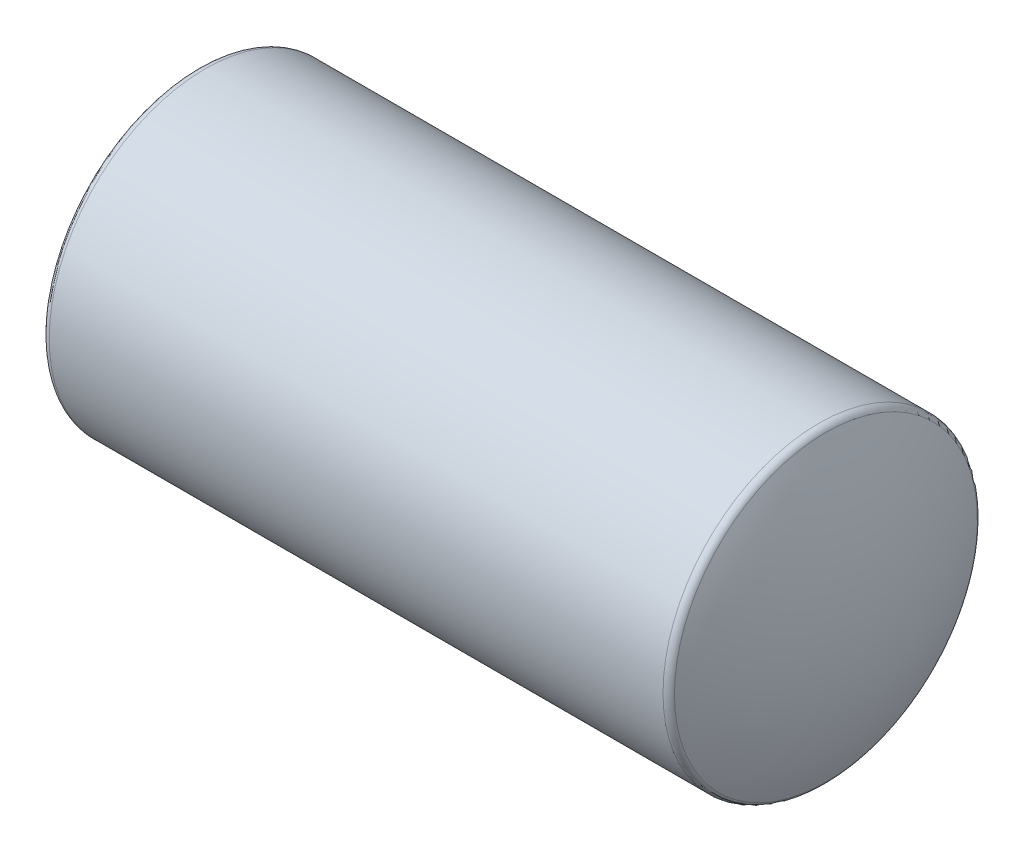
ISO-10303-21;
HEADER;
FILE_DESCRIPTION(('STEP AP214'),'2;1');
FILE_NAME('part.step','',(''),(''),'','','');
FILE_SCHEMA(('AUTOMOTIVE_DESIGN { 1 0 10303 214 1 1 1 1 }'));
ENDSEC;
DATA;
#1=APPLICATION_CONTEXT('core data for automotive mechanical design processes');
#2=APPLICATION_PROTOCOL_DEFINITION('international standard','automotive_design',2000,#1);
#3=PRODUCT_CONTEXT('',#1,'mechanical');
#4=PRODUCT('Part','Part','',(#3));
#5=PRODUCT_RELATED_PRODUCT_CATEGORY('part','',(#4));
#6=PRODUCT_DEFINITION_FORMATION('','',#4);
#7=PRODUCT_DEFINITION_CONTEXT('part definition',#1,'design');
#8=PRODUCT_DEFINITION('design','',#6,#7);
#9=PRODUCT_DEFINITION_SHAPE('','',#8);
#10=(LENGTH_UNIT() NAMED_UNIT(*) SI_UNIT(.MILLI.,.METRE.));
#11=(NAMED_UNIT(*) PLANE_ANGLE_UNIT() SI_UNIT($,.RADIAN.));
#12=(NAMED_UNIT(*) SI_UNIT($,.STERADIAN.) SOLID_ANGLE_UNIT());
#13=UNCERTAINTY_MEASURE_WITH_UNIT(LENGTH_MEASURE(1.E-05),#10,'distance_accuracy_value','');
#14=(GEOMETRIC_REPRESENTATION_CONTEXT(3) GLOBAL_UNCERTAINTY_ASSIGNED_CONTEXT((#13)) GLOBAL_UNIT_ASSIGNED_CONTEXT((#10,
#11,#12)) REPRESENTATION_CONTEXT('',''));
#15=CARTESIAN_POINT('',(0.,0.,0.));
#16=DIRECTION('',(0.,0.,1.));
#17=DIRECTION('',(1.,0.,0.));
#18=AXIS2_PLACEMENT_3D('',#15,#16,#17);
#19=CARTESIAN_POINT('',(0.,0.,0.));
#20=DIRECTION('',(-1.,0.,0.));
#21=DIRECTION('',(0.,1.,0.));
#22=AXIS2_PLACEMENT_3D('',#19,#20,#21);
#23=SPHERICAL_SURFACE('',#22,8.94427190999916);
#24=CARTESIAN_POINT('',(8.05555083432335,0.,0.));
#25=DIRECTION('',(-1.,0.,0.));
#26=DIRECTION('',(0.,0.,1.));
#27=AXIS2_PLACEMENT_3D('',#24,#25,#26);
#28=CIRCLE('',#27,3.88691404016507);
#29=CARTESIAN_POINT('',(8.05555083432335,0.,3.88691404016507));
#30=VERTEX_POINT('',#29);
#31=EDGE_CURVE('E10',#30,#30,#28,.F.);
#32=ORIENTED_EDGE('',*,*,#31,.T.);
#33=EDGE_LOOP('',(#32));
#34=FACE_BOUND('',#33,.T.);
#35=ADVANCED_FACE('F29',(#34),#23,.T.);
#36=CARTESIAN_POINT('',(-8.94427190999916,0.,0.));
#37=DIRECTION('',(-1.,0.,0.));
#38=DIRECTION('',(0.,0.,1.));
#39=AXIS2_PLACEMENT_3D('',#36,#37,#38);
#40=CYLINDRICAL_SURFACE('',#39,4.);
#41=CARTESIAN_POINT('',(-7.87542324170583,0.,0.));
#42=DIRECTION('',(1.,0.,0.));
#43=DIRECTION('',(0.,0.,-1.));
#44=AXIS2_PLACEMENT_3D('',#41,#42,#43);
#45=CIRCLE('',#44,4.);
#46=CARTESIAN_POINT('',(-7.87542324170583,0.,-4.));
#47=VERTEX_POINT('',#46);
#48=EDGE_CURVE('E36',#47,#47,#45,.T.);
#49=ORIENTED_EDGE('',*,*,#48,.T.);
#50=EDGE_LOOP('',(#49));
#51=FACE_BOUND('',#50,.T.);
#52=CARTESIAN_POINT('',(7.87542324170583,0.,0.));
#53=DIRECTION('',(-1.,0.,0.));
#54=DIRECTION('',(0.,0.,1.));
#55=AXIS2_PLACEMENT_3D('',#52,#53,#54);
#56=CIRCLE('',#55,4.);
#57=CARTESIAN_POINT('',(7.87542324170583,0.,4.));
#58=VERTEX_POINT('',#57);
#59=EDGE_CURVE('E40',#58,#58,#56,.T.);
#60=ORIENTED_EDGE('',*,*,#59,.T.);
#61=EDGE_LOOP('',(#60));
#62=FACE_BOUND('',#61,.T.);
#63=ADVANCED_FACE('F60',(#51,#62),#40,.T.);
#64=CARTESIAN_POINT('',(0.,0.,0.));
#65=DIRECTION('',(-1.,0.,0.));
#66=DIRECTION('',(0.,1.,0.));
#67=AXIS2_PLACEMENT_3D('',#64,#65,#66);
#68=SPHERICAL_SURFACE('',#67,8.94427190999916);
#69=CARTESIAN_POINT('',(-8.05555083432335,0.,0.));
#70=DIRECTION('',(1.,0.,0.));
#71=DIRECTION('',(0.,0.,-1.));
#72=AXIS2_PLACEMENT_3D('',#69,#70,#71);
#73=CIRCLE('',#72,3.88691404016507);
#74=CARTESIAN_POINT('',(-8.05555083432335,0.,-3.88691404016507));
#75=VERTEX_POINT('',#74);
#76=EDGE_CURVE('E44',#75,#75,#73,.F.);
#77=ORIENTED_EDGE('',*,*,#76,.T.);
#78=EDGE_LOOP('',(#77));
#79=FACE_BOUND('',#78,.T.);
#80=ADVANCED_FACE('F50',(#79),#68,.T.);
#81=CARTESIAN_POINT('',(-7.87542324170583,0.,0.));
#82=DIRECTION('',(1.,0.,0.));
#83=DIRECTION('',(0.,0.,-1.));
#84=AXIS2_PLACEMENT_3D('',#81,#82,#83);
#85=TOROIDAL_SURFACE('',#84,3.8,0.2);
#86=ORIENTED_EDGE('',*,*,#48,.F.);
#87=EDGE_LOOP('',(#86));
#88=FACE_BOUND('',#87,.T.);
#89=ORIENTED_EDGE('',*,*,#76,.F.);
#90=EDGE_LOOP('',(#89));
#91=FACE_BOUND('',#90,.T.);
#92=ADVANCED_FACE('F52',(#88,#91),#85,.T.);
#93=CARTESIAN_POINT('',(7.87542324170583,0.,0.));
#94=DIRECTION('',(-1.,0.,0.));
#95=DIRECTION('',(0.,0.,1.));
#96=AXIS2_PLACEMENT_3D('',#93,#94,#95);
#97=TOROIDAL_SURFACE('',#96,3.8,0.2);
#98=ORIENTED_EDGE('',*,*,#31,.F.);
#99=EDGE_LOOP('',(#98));
#100=FACE_BOUND('',#99,.T.);
#101=ORIENTED_EDGE('',*,*,#59,.F.);
#102=EDGE_LOOP('',(#101));
#103=FACE_BOUND('',#102,.T.);
#104=ADVANCED_FACE('F31',(#100,#103),#97,.T.);
#105=CLOSED_SHELL('',(#35,#63,#80,#92,#104));
#106=MANIFOLD_SOLID_BREP('B2',#105);
#107=ADVANCED_BREP_SHAPE_REPRESENTATION('',(#18,#106),#14);
#108=SHAPE_DEFINITION_REPRESENTATION(#9,#107);
ENDSEC;
END-ISO-10303-21;
